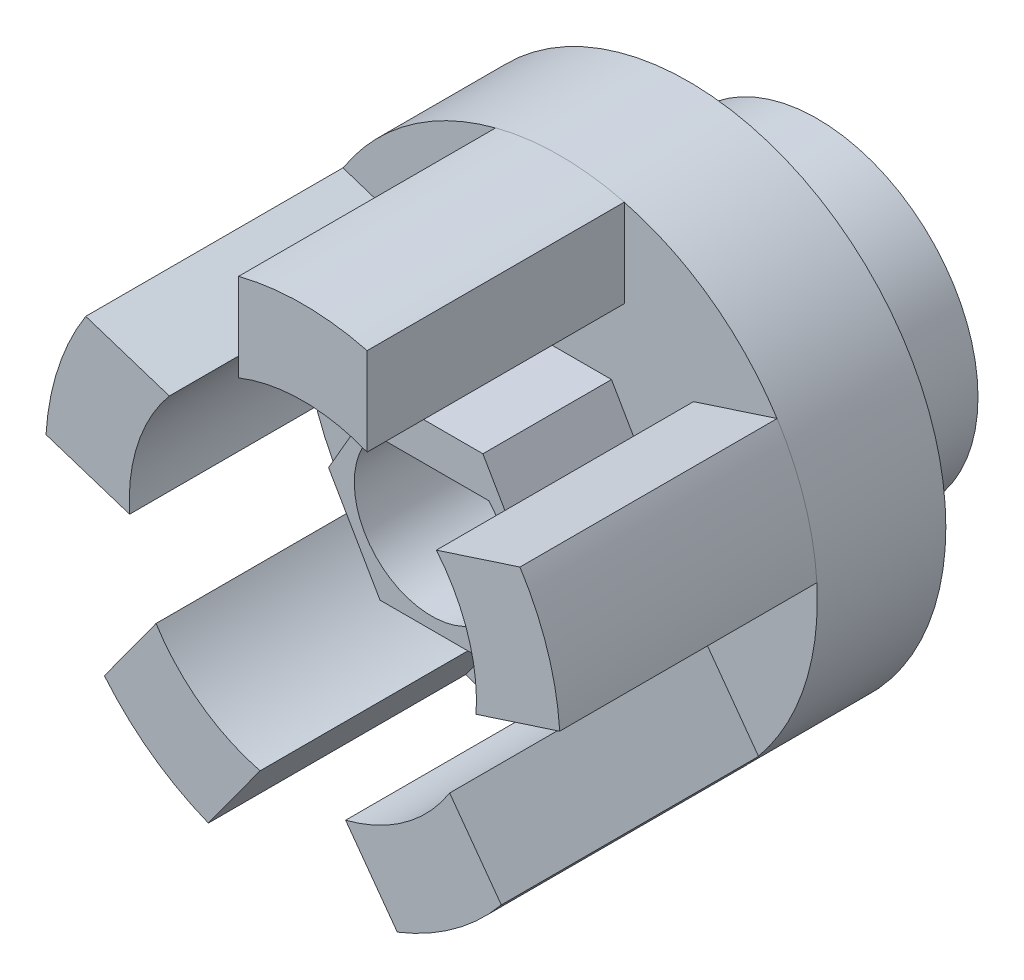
ISO-10303-21;
HEADER;
FILE_DESCRIPTION(('STEP AP214'),'2;1');
FILE_NAME('part.step','',(''),(''),'','','');
FILE_SCHEMA(('AUTOMOTIVE_DESIGN { 1 0 10303 214 1 1 1 1 }'));
ENDSEC;
DATA;
#1=APPLICATION_CONTEXT('core data for automotive mechanical design processes');
#2=APPLICATION_PROTOCOL_DEFINITION('international standard','automotive_design',2000,#1);
#3=PRODUCT_CONTEXT('',#1,'mechanical');
#4=PRODUCT('Part','Part','',(#3));
#5=PRODUCT_RELATED_PRODUCT_CATEGORY('part','',(#4));
#6=PRODUCT_DEFINITION_FORMATION('','',#4);
#7=PRODUCT_DEFINITION_CONTEXT('part definition',#1,'design');
#8=PRODUCT_DEFINITION('design','',#6,#7);
#9=PRODUCT_DEFINITION_SHAPE('','',#8);
#10=(LENGTH_UNIT() NAMED_UNIT(*) SI_UNIT(.MILLI.,.METRE.));
#11=(NAMED_UNIT(*) PLANE_ANGLE_UNIT() SI_UNIT($,.RADIAN.));
#12=(NAMED_UNIT(*) SI_UNIT($,.STERADIAN.) SOLID_ANGLE_UNIT());
#13=UNCERTAINTY_MEASURE_WITH_UNIT(LENGTH_MEASURE(1.E-05),#10,'distance_accuracy_value','');
#14=(GEOMETRIC_REPRESENTATION_CONTEXT(3) GLOBAL_UNCERTAINTY_ASSIGNED_CONTEXT((#13)) GLOBAL_UNIT_ASSIGNED_CONTEXT((#10,
#11,#12)) REPRESENTATION_CONTEXT('',''));
#15=CARTESIAN_POINT('',(0.,0.,0.));
#16=DIRECTION('',(0.,0.,1.));
#17=DIRECTION('',(1.,0.,0.));
#18=AXIS2_PLACEMENT_3D('',#15,#16,#17);
#19=CARTESIAN_POINT('',(0.,0.,5.08));
#20=DIRECTION('',(0.,0.,1.));
#21=DIRECTION('',(1.,0.,0.));
#22=AXIS2_PLACEMENT_3D('',#19,#20,#21);
#23=PLANE('',#22);
#24=DIRECTION('',(0.5,0.866025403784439,0.));
#25=VECTOR('',#24,1.);
#26=CARTESIAN_POINT('',(1.016,-1.75976362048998,5.08));
#27=LINE('',#26,#25);
#28=CARTESIAN_POINT('',(1.016,-1.75976362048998,5.08));
#29=VERTEX_POINT('',#28);
#30=CARTESIAN_POINT('',(2.032,0.,5.08));
#31=VERTEX_POINT('',#30);
#32=EDGE_CURVE('E441',#29,#31,#27,.T.);
#33=ORIENTED_EDGE('',*,*,#32,.F.);
#34=DIRECTION('',(1.,0.,0.));
#35=VECTOR('',#34,1.);
#36=CARTESIAN_POINT('',(-1.016,-1.75976362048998,5.08));
#37=LINE('',#36,#35);
#38=CARTESIAN_POINT('',(-1.016,-1.75976362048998,5.08));
#39=VERTEX_POINT('',#38);
#40=EDGE_CURVE('E448',#39,#29,#37,.T.);
#41=ORIENTED_EDGE('',*,*,#40,.F.);
#42=DIRECTION('',(0.5,-0.866025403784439,0.));
#43=VECTOR('',#42,1.);
#44=CARTESIAN_POINT('',(-2.032,0.,5.08));
#45=LINE('',#44,#43);
#46=CARTESIAN_POINT('',(-2.032,0.,5.08));
#47=VERTEX_POINT('',#46);
#48=EDGE_CURVE('E470',#47,#39,#45,.T.);
#49=ORIENTED_EDGE('',*,*,#48,.F.);
#50=DIRECTION('',(-0.5,-0.866025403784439,0.));
#51=VECTOR('',#50,1.);
#52=CARTESIAN_POINT('',(-1.016,1.75976362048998,5.08));
#53=LINE('',#52,#51);
#54=CARTESIAN_POINT('',(-1.016,1.75976362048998,5.08));
#55=VERTEX_POINT('',#54);
#56=EDGE_CURVE('E467',#55,#47,#53,.T.);
#57=ORIENTED_EDGE('',*,*,#56,.F.);
#58=DIRECTION('',(-1.,0.,0.));
#59=VECTOR('',#58,1.);
#60=CARTESIAN_POINT('',(1.016,1.75976362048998,5.08));
#61=LINE('',#60,#59);
#62=CARTESIAN_POINT('',(1.016,1.75976362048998,5.08));
#63=VERTEX_POINT('',#62);
#64=EDGE_CURVE('E464',#63,#55,#61,.T.);
#65=ORIENTED_EDGE('',*,*,#64,.F.);
#66=DIRECTION('',(-0.5,0.866025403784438,0.));
#67=VECTOR('',#66,1.);
#68=CARTESIAN_POINT('',(2.032,0.,5.08));
#69=LINE('',#68,#67);
#70=EDGE_CURVE('E461',#31,#63,#69,.T.);
#71=ORIENTED_EDGE('',*,*,#70,.F.);
#72=EDGE_LOOP('',(#33,#41,#49,#57,#65,#71));
#73=FACE_BOUND('',#72,.T.);
#74=CARTESIAN_POINT('',(0.,0.,5.08));
#75=DIRECTION('',(0.,0.,-1.));
#76=DIRECTION('',(1.,0.,0.));
#77=AXIS2_PLACEMENT_3D('',#74,#75,#76);
#78=CIRCLE('',#77,3.429);
#79=CARTESIAN_POINT('',(-3.42170334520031,-0.223578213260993,5.08));
#80=VERTEX_POINT('',#79);
#81=CARTESIAN_POINT('',(-2.63680017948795,2.1921053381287,5.08));
#82=VERTEX_POINT('',#81);
#83=EDGE_CURVE('E48',#80,#82,#78,.T.);
#84=ORIENTED_EDGE('',*,*,#83,.F.);
#85=DIRECTION('',(0.951056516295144,-0.309016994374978,0.));
#86=VECTOR('',#85,1.);
#87=CARTESIAN_POINT('',(-5.07304007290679,0.312973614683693,5.08));
#88=LINE('',#87,#86);
#89=CARTESIAN_POINT('',(-5.07040266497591,0.31211666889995,5.08));
#90=VERTEX_POINT('',#89);
#91=EDGE_CURVE('E937',#90,#80,#88,.T.);
#92=ORIENTED_EDGE('',*,*,#91,.F.);
#93=CARTESIAN_POINT('',(0.,0.,5.08));
#94=DIRECTION('',(0.,0.,1.));
#95=DIRECTION('',(1.,0.,0.));
#96=AXIS2_PLACEMENT_3D('',#93,#94,#95);
#97=CIRCLE('',#96,5.08);
#98=CARTESIAN_POINT('',(-3.91858434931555,-3.23281559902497,5.08));
#99=VERTEX_POINT('',#98);
#100=EDGE_CURVE('E427',#90,#99,#97,.T.);
#101=ORIENTED_EDGE('',*,*,#100,.T.);
#102=DIRECTION('',(-0.587785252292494,-0.809016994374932,0.));
#103=VECTOR('',#102,1.);
#104=CARTESIAN_POINT('',(-3.92021435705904,-3.23505911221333,5.08));
#105=LINE('',#104,#103);
#106=CARTESIAN_POINT('',(-2.89963213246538,-1.83034818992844,5.08));
#107=VERTEX_POINT('',#106);
#108=EDGE_CURVE('E286',#107,#99,#105,.T.);
#109=ORIENTED_EDGE('',*,*,#108,.F.);
#110=CARTESIAN_POINT('',(0.,0.,5.08));
#111=DIRECTION('',(0.,0.,-1.));
#112=DIRECTION('',(1.,0.,0.));
#113=AXIS2_PLACEMENT_3D('',#110,#111,#112);
#114=CIRCLE('',#113,3.429);
#115=CARTESIAN_POINT('',(-0.844728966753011,-3.32332273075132,5.08));
#116=VERTEX_POINT('',#115);
#117=EDGE_CURVE('E296',#116,#107,#114,.T.);
#118=ORIENTED_EDGE('',*,*,#117,.F.);
#119=DIRECTION('',(0.587785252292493,0.809016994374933,0.));
#120=VECTOR('',#119,1.);
#121=CARTESIAN_POINT('',(-1.86531119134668,-4.72803365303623,5.08));
#122=LINE('',#121,#120);
#123=CARTESIAN_POINT('',(-1.8636811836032,-4.72579013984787,5.08));
#124=VERTEX_POINT('',#123);
#125=EDGE_CURVE('E276',#124,#116,#122,.T.);
#126=ORIENTED_EDGE('',*,*,#125,.F.);
#127=CARTESIAN_POINT('',(1.86368118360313,-4.7257901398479,5.08));
#128=VERTEX_POINT('',#127);
#129=EDGE_CURVE('E936',#124,#128,#97,.T.);
#130=ORIENTED_EDGE('',*,*,#129,.T.);
#131=DIRECTION('',(0.58778525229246,-0.809016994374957,0.));
#132=VECTOR('',#131,1.);
#133=CARTESIAN_POINT('',(1.86531119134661,-4.72803365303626,5.08));
#134=LINE('',#133,#132);
#135=CARTESIAN_POINT('',(0.844728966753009,-3.32332273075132,5.08));
#136=VERTEX_POINT('',#135);
#137=EDGE_CURVE('E318',#136,#128,#134,.T.);
#138=ORIENTED_EDGE('',*,*,#137,.F.);
#139=CARTESIAN_POINT('',(0.,0.,5.08));
#140=DIRECTION('',(0.,0.,-1.));
#141=DIRECTION('',(1.,0.,0.));
#142=AXIS2_PLACEMENT_3D('',#139,#140,#141);
#143=CIRCLE('',#142,3.429);
#144=CARTESIAN_POINT('',(2.89963213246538,-1.83034818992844,5.08));
#145=VERTEX_POINT('',#144);
#146=EDGE_CURVE('E331',#145,#136,#143,.T.);
#147=ORIENTED_EDGE('',*,*,#146,.F.);
#148=DIRECTION('',(-0.58778525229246,0.809016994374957,0.));
#149=VECTOR('',#148,1.);
#150=CARTESIAN_POINT('',(3.92021435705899,-3.23505911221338,5.08));
#151=LINE('',#150,#149);
#152=CARTESIAN_POINT('',(3.91858434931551,-3.23281559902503,5.08));
#153=VERTEX_POINT('',#152);
#154=EDGE_CURVE('E327',#153,#145,#151,.T.);
#155=ORIENTED_EDGE('',*,*,#154,.F.);
#156=CARTESIAN_POINT('',(5.07040266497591,0.312116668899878,5.08));
#157=VERTEX_POINT('',#156);
#158=EDGE_CURVE('E418',#153,#157,#97,.T.);
#159=ORIENTED_EDGE('',*,*,#158,.T.);
#160=DIRECTION('',(0.951056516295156,0.309016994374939,0.));
#161=VECTOR('',#160,1.);
#162=CARTESIAN_POINT('',(5.07304007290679,0.312973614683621,5.08));
#163=LINE('',#162,#161);
#164=CARTESIAN_POINT('',(3.42170334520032,-0.223578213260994,5.08));
#165=VERTEX_POINT('',#164);
#166=EDGE_CURVE('E388',#165,#157,#163,.T.);
#167=ORIENTED_EDGE('',*,*,#166,.F.);
#168=CARTESIAN_POINT('',(0.,0.,5.08));
#169=DIRECTION('',(0.,0.,-1.));
#170=DIRECTION('',(1.,0.,0.));
#171=AXIS2_PLACEMENT_3D('',#168,#169,#170);
#172=CIRCLE('',#171,3.429);
#173=CARTESIAN_POINT('',(2.63680017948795,2.1921053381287,5.08));
#174=VERTEX_POINT('',#173);
#175=EDGE_CURVE('E401',#174,#165,#172,.T.);
#176=ORIENTED_EDGE('',*,*,#175,.F.);
#177=DIRECTION('',(-0.951056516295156,-0.30901699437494,0.));
#178=VECTOR('',#177,1.);
#179=CARTESIAN_POINT('',(4.28813690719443,2.72865716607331,5.08));
#180=LINE('',#179,#178);
#181=CARTESIAN_POINT('',(4.28549949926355,2.72780022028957,5.08));
#182=VERTEX_POINT('',#181);
#183=EDGE_CURVE('E397',#182,#174,#180,.T.);
#184=ORIENTED_EDGE('',*,*,#183,.F.);
#185=CARTESIAN_POINT('',(1.27,4.91868884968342,5.08));
#186=VERTEX_POINT('',#185);
#187=EDGE_CURVE('E426',#182,#186,#97,.T.);
#188=ORIENTED_EDGE('',*,*,#187,.T.);
#189=DIRECTION('',(0.,1.,0.));
#190=VECTOR('',#189,1.);
#191=CARTESIAN_POINT('',(1.27,4.92146198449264,5.08));
#192=LINE('',#191,#190);
#193=CARTESIAN_POINT('',(1.27,3.18514379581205,5.08));
#194=VERTEX_POINT('',#193);
#195=EDGE_CURVE('E353',#194,#186,#192,.T.);
#196=ORIENTED_EDGE('',*,*,#195,.F.);
#197=CARTESIAN_POINT('',(0.,0.,5.08));
#198=DIRECTION('',(0.,0.,-1.));
#199=DIRECTION('',(1.,0.,0.));
#200=AXIS2_PLACEMENT_3D('',#197,#198,#199);
#201=CIRCLE('',#200,3.429);
#202=CARTESIAN_POINT('',(-1.27,3.18514379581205,5.08));
#203=VERTEX_POINT('',#202);
#204=EDGE_CURVE('E366',#203,#194,#201,.T.);
#205=ORIENTED_EDGE('',*,*,#204,.F.);
#206=DIRECTION('',(0.,-1.,0.));
#207=VECTOR('',#206,1.);
#208=CARTESIAN_POINT('',(-1.27,4.92146198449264,5.08));
#209=LINE('',#208,#207);
#210=CARTESIAN_POINT('',(-1.27,4.91868884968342,5.08));
#211=VERTEX_POINT('',#210);
#212=EDGE_CURVE('E362',#211,#203,#209,.T.);
#213=ORIENTED_EDGE('',*,*,#212,.F.);
#214=CARTESIAN_POINT('',(-4.28549949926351,2.72780022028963,5.08));
#215=VERTEX_POINT('',#214);
#216=EDGE_CURVE('E935',#211,#215,#97,.T.);
#217=ORIENTED_EDGE('',*,*,#216,.T.);
#218=DIRECTION('',(-0.951056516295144,0.309016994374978,0.));
#219=VECTOR('',#218,1.);
#220=CARTESIAN_POINT('',(-4.28813690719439,2.72865716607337,5.08));
#221=LINE('',#220,#219);
#222=EDGE_CURVE('E53',#82,#215,#221,.T.);
#223=ORIENTED_EDGE('',*,*,#222,.F.);
#224=EDGE_LOOP('',(#84,#92,#101,#109,#118,#126,#130,#138,#147,#155,#159,#167,#176,#184,#188,
#196,#205,#213,#217,#223));
#225=FACE_BOUND('',#224,.T.);
#226=ADVANCED_FACE('F33',(#73,#225),#23,.T.);
#227=CARTESIAN_POINT('',(0.,0.,5.08));
#228=DIRECTION('',(0.,0.,-1.));
#229=DIRECTION('',(-1.,0.,0.));
#230=AXIS2_PLACEMENT_3D('',#227,#228,#229);
#231=CYLINDRICAL_SURFACE('',#230,3.175);
#232=CARTESIAN_POINT('',(0.,0.,0.));
#233=DIRECTION('',(0.,0.,1.));
#234=DIRECTION('',(1.,0.,0.));
#235=AXIS2_PLACEMENT_3D('',#232,#233,#234);
#236=CIRCLE('',#235,3.175);
#237=CARTESIAN_POINT('',(3.175,0.,0.));
#238=VERTEX_POINT('',#237);
#239=EDGE_CURVE('E41',#238,#238,#236,.T.);
#240=ORIENTED_EDGE('',*,*,#239,.T.);
#241=EDGE_LOOP('',(#240));
#242=FACE_BOUND('',#241,.T.);
#243=CARTESIAN_POINT('',(0.,0.,2.54));
#244=DIRECTION('',(0.,0.,1.));
#245=DIRECTION('',(1.,0.,0.));
#246=AXIS2_PLACEMENT_3D('',#243,#244,#245);
#247=CIRCLE('',#246,3.175);
#248=CARTESIAN_POINT('',(3.175,0.,2.54));
#249=VERTEX_POINT('',#248);
#250=EDGE_CURVE('E11',#249,#249,#247,.T.);
#251=ORIENTED_EDGE('',*,*,#250,.F.);
#252=EDGE_LOOP('',(#251));
#253=FACE_BOUND('',#252,.T.);
#254=ADVANCED_FACE('F35',(#242,#253),#231,.T.);
#255=CARTESIAN_POINT('',(0.,0.,0.));
#256=DIRECTION('',(0.,0.,1.));
#257=DIRECTION('',(1.,0.,0.));
#258=AXIS2_PLACEMENT_3D('',#255,#256,#257);
#259=PLANE('',#258);
#260=DIRECTION('',(1.,0.,0.));
#261=VECTOR('',#260,1.);
#262=CARTESIAN_POINT('',(1.13592253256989,1.016,0.));
#263=LINE('',#262,#261);
#264=CARTESIAN_POINT('',(-1.13592253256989,1.016,0.));
#265=VERTEX_POINT('',#264);
#266=CARTESIAN_POINT('',(1.13592253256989,1.016,0.));
#267=VERTEX_POINT('',#266);
#268=EDGE_CURVE('E432',#265,#267,#263,.T.);
#269=ORIENTED_EDGE('',*,*,#268,.F.);
#270=CARTESIAN_POINT('',(0.,0.,0.));
#271=DIRECTION('',(0.,0.,-1.));
#272=DIRECTION('',(-1.,0.,0.));
#273=AXIS2_PLACEMENT_3D('',#270,#271,#272);
#274=CIRCLE('',#273,1.524);
#275=EDGE_CURVE('E422',#267,#265,#274,.T.);
#276=ORIENTED_EDGE('',*,*,#275,.F.);
#277=EDGE_LOOP('',(#269,#276));
#278=FACE_BOUND('',#277,.T.);
#279=ORIENTED_EDGE('',*,*,#239,.F.);
#280=EDGE_LOOP('',(#279));
#281=FACE_BOUND('',#280,.T.);
#282=ADVANCED_FACE('F496',(#278,#281),#259,.F.);
#283=CARTESIAN_POINT('',(1.016,-1.75976362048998,7.62));
#284=DIRECTION('',(-0.866025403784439,0.5,0.));
#285=DIRECTION('',(-0.5,-0.866025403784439,0.));
#286=AXIS2_PLACEMENT_3D('',#283,#284,#285);
#287=PLANE('',#286);
#288=ORIENTED_EDGE('',*,*,#32,.T.);
#289=DIRECTION('',(0.,0.,-1.));
#290=VECTOR('',#289,1.);
#291=CARTESIAN_POINT('',(2.032,0.,7.62));
#292=LINE('',#291,#290);
#293=CARTESIAN_POINT('',(2.032,0.,7.62));
#294=VERTEX_POINT('',#293);
#295=EDGE_CURVE('E489',#294,#31,#292,.T.);
#296=ORIENTED_EDGE('',*,*,#295,.F.);
#297=DIRECTION('',(0.5,0.866025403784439,0.));
#298=VECTOR('',#297,1.);
#299=CARTESIAN_POINT('',(1.016,-1.75976362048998,7.62));
#300=LINE('',#299,#298);
#301=CARTESIAN_POINT('',(1.016,-1.75976362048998,7.62));
#302=VERTEX_POINT('',#301);
#303=EDGE_CURVE('E444',#302,#294,#300,.T.);
#304=ORIENTED_EDGE('',*,*,#303,.F.);
#305=DIRECTION('',(0.,0.,-1.));
#306=VECTOR('',#305,1.);
#307=CARTESIAN_POINT('',(1.016,-1.75976362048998,7.62));
#308=LINE('',#307,#306);
#309=EDGE_CURVE('E458',#302,#29,#308,.T.);
#310=ORIENTED_EDGE('',*,*,#309,.T.);
#311=EDGE_LOOP('',(#288,#296,#304,#310));
#312=FACE_BOUND('',#311,.T.);
#313=ADVANCED_FACE('F498',(#312),#287,.F.);
#314=CARTESIAN_POINT('',(2.032,0.,7.62));
#315=DIRECTION('',(-0.866025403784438,-0.5,0.));
#316=DIRECTION('',(0.5,-0.866025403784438,0.));
#317=AXIS2_PLACEMENT_3D('',#314,#315,#316);
#318=PLANE('',#317);
#319=ORIENTED_EDGE('',*,*,#70,.T.);
#320=DIRECTION('',(0.,0.,-1.));
#321=VECTOR('',#320,1.);
#322=CARTESIAN_POINT('',(1.016,1.75976362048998,7.62));
#323=LINE('',#322,#321);
#324=CARTESIAN_POINT('',(1.016,1.75976362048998,7.62));
#325=VERTEX_POINT('',#324);
#326=EDGE_CURVE('E486',#325,#63,#323,.T.);
#327=ORIENTED_EDGE('',*,*,#326,.F.);
#328=DIRECTION('',(-0.5,0.866025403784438,0.));
#329=VECTOR('',#328,1.);
#330=CARTESIAN_POINT('',(2.032,0.,7.62));
#331=LINE('',#330,#329);
#332=EDGE_CURVE('E447',#294,#325,#331,.T.);
#333=ORIENTED_EDGE('',*,*,#332,.F.);
#334=ORIENTED_EDGE('',*,*,#295,.T.);
#335=EDGE_LOOP('',(#319,#327,#333,#334));
#336=FACE_BOUND('',#335,.T.);
#337=ADVANCED_FACE('F504',(#336),#318,.F.);
#338=CARTESIAN_POINT('',(1.016,1.75976362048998,7.62));
#339=DIRECTION('',(0.,-1.,0.));
#340=DIRECTION('',(0.,0.,-1.));
#341=AXIS2_PLACEMENT_3D('',#338,#339,#340);
#342=PLANE('',#341);
#343=ORIENTED_EDGE('',*,*,#64,.T.);
#344=DIRECTION('',(0.,0.,-1.));
#345=VECTOR('',#344,1.);
#346=CARTESIAN_POINT('',(-1.016,1.75976362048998,7.62));
#347=LINE('',#346,#345);
#348=CARTESIAN_POINT('',(-1.016,1.75976362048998,7.62));
#349=VERTEX_POINT('',#348);
#350=EDGE_CURVE('E483',#349,#55,#347,.T.);
#351=ORIENTED_EDGE('',*,*,#350,.F.);
#352=DIRECTION('',(-1.,0.,0.));
#353=VECTOR('',#352,1.);
#354=CARTESIAN_POINT('',(1.016,1.75976362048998,7.62));
#355=LINE('',#354,#353);
#356=EDGE_CURVE('E450',#325,#349,#355,.T.);
#357=ORIENTED_EDGE('',*,*,#356,.F.);
#358=ORIENTED_EDGE('',*,*,#326,.T.);
#359=EDGE_LOOP('',(#343,#351,#357,#358));
#360=FACE_BOUND('',#359,.T.);
#361=ADVANCED_FACE('F516',(#360),#342,.F.);
#362=CARTESIAN_POINT('',(-1.016,1.75976362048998,7.62));
#363=DIRECTION('',(0.866025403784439,-0.5,0.));
#364=DIRECTION('',(0.5,0.866025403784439,0.));
#365=AXIS2_PLACEMENT_3D('',#362,#363,#364);
#366=PLANE('',#365);
#367=ORIENTED_EDGE('',*,*,#56,.T.);
#368=DIRECTION('',(0.,0.,-1.));
#369=VECTOR('',#368,1.);
#370=CARTESIAN_POINT('',(-2.032,0.,7.62));
#371=LINE('',#370,#369);
#372=CARTESIAN_POINT('',(-2.032,0.,7.62));
#373=VERTEX_POINT('',#372);
#374=EDGE_CURVE('E480',#373,#47,#371,.T.);
#375=ORIENTED_EDGE('',*,*,#374,.F.);
#376=DIRECTION('',(-0.5,-0.866025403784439,0.));
#377=VECTOR('',#376,1.);
#378=CARTESIAN_POINT('',(-1.016,1.75976362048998,7.62));
#379=LINE('',#378,#377);
#380=EDGE_CURVE('E452',#349,#373,#379,.T.);
#381=ORIENTED_EDGE('',*,*,#380,.F.);
#382=ORIENTED_EDGE('',*,*,#350,.T.);
#383=EDGE_LOOP('',(#367,#375,#381,#382));
#384=FACE_BOUND('',#383,.T.);
#385=ADVANCED_FACE('F520',(#384),#366,.F.);
#386=CARTESIAN_POINT('',(-2.032,0.,7.62));
#387=DIRECTION('',(0.866025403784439,0.5,0.));
#388=DIRECTION('',(-0.5,0.866025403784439,0.));
#389=AXIS2_PLACEMENT_3D('',#386,#387,#388);
#390=PLANE('',#389);
#391=ORIENTED_EDGE('',*,*,#48,.T.);
#392=DIRECTION('',(0.,0.,-1.));
#393=VECTOR('',#392,1.);
#394=CARTESIAN_POINT('',(-1.016,-1.75976362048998,7.62));
#395=LINE('',#394,#393);
#396=CARTESIAN_POINT('',(-1.016,-1.75976362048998,7.62));
#397=VERTEX_POINT('',#396);
#398=EDGE_CURVE('E477',#397,#39,#395,.T.);
#399=ORIENTED_EDGE('',*,*,#398,.F.);
#400=DIRECTION('',(0.5,-0.866025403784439,0.));
#401=VECTOR('',#400,1.);
#402=CARTESIAN_POINT('',(-2.032,0.,7.62));
#403=LINE('',#402,#401);
#404=EDGE_CURVE('E454',#373,#397,#403,.T.);
#405=ORIENTED_EDGE('',*,*,#404,.F.);
#406=ORIENTED_EDGE('',*,*,#374,.T.);
#407=EDGE_LOOP('',(#391,#399,#405,#406));
#408=FACE_BOUND('',#407,.T.);
#409=ADVANCED_FACE('F524',(#408),#390,.F.);
#410=CARTESIAN_POINT('',(-1.016,-1.75976362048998,7.62));
#411=DIRECTION('',(0.,1.,0.));
#412=DIRECTION('',(-1.,0.,0.));
#413=AXIS2_PLACEMENT_3D('',#410,#411,#412);
#414=PLANE('',#413);
#415=ORIENTED_EDGE('',*,*,#40,.T.);
#416=ORIENTED_EDGE('',*,*,#309,.F.);
#417=DIRECTION('',(1.,0.,0.));
#418=VECTOR('',#417,1.);
#419=CARTESIAN_POINT('',(-1.016,-1.75976362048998,7.62));
#420=LINE('',#419,#418);
#421=EDGE_CURVE('E456',#397,#302,#420,.T.);
#422=ORIENTED_EDGE('',*,*,#421,.F.);
#423=ORIENTED_EDGE('',*,*,#398,.T.);
#424=EDGE_LOOP('',(#415,#416,#422,#423));
#425=FACE_BOUND('',#424,.T.);
#426=ADVANCED_FACE('F528',(#425),#414,.F.);
#427=CARTESIAN_POINT('',(0.,0.,7.62));
#428=DIRECTION('',(0.,0.,1.));
#429=DIRECTION('',(1.,0.,0.));
#430=AXIS2_PLACEMENT_3D('',#427,#428,#429);
#431=PLANE('',#430);
#432=CARTESIAN_POINT('',(0.,0.,7.62));
#433=DIRECTION('',(0.,0.,-1.));
#434=DIRECTION('',(-1.,0.,0.));
#435=AXIS2_PLACEMENT_3D('',#432,#433,#434);
#436=CIRCLE('',#435,1.524);
#437=CARTESIAN_POINT('',(1.13592253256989,1.016,7.62));
#438=VERTEX_POINT('',#437);
#439=CARTESIAN_POINT('',(-1.13592253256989,1.016,7.62));
#440=VERTEX_POINT('',#439);
#441=EDGE_CURVE('E428',#438,#440,#436,.T.);
#442=ORIENTED_EDGE('',*,*,#441,.T.);
#443=DIRECTION('',(1.,0.,0.));
#444=VECTOR('',#443,1.);
#445=CARTESIAN_POINT('',(1.13592253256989,1.016,7.62));
#446=LINE('',#445,#444);
#447=EDGE_CURVE('E431',#440,#438,#446,.T.);
#448=ORIENTED_EDGE('',*,*,#447,.T.);
#449=EDGE_LOOP('',(#442,#448));
#450=FACE_BOUND('',#449,.T.);
#451=ORIENTED_EDGE('',*,*,#303,.T.);
#452=ORIENTED_EDGE('',*,*,#332,.T.);
#453=ORIENTED_EDGE('',*,*,#356,.T.);
#454=ORIENTED_EDGE('',*,*,#380,.T.);
#455=ORIENTED_EDGE('',*,*,#404,.T.);
#456=ORIENTED_EDGE('',*,*,#421,.T.);
#457=EDGE_LOOP('',(#451,#452,#453,#454,#455,#456));
#458=FACE_BOUND('',#457,.T.);
#459=ADVANCED_FACE('F532',(#450,#458),#431,.T.);
#460=CARTESIAN_POINT('',(0.,0.,7.62));
#461=DIRECTION('',(0.,0.,-1.));
#462=DIRECTION('',(-1.,0.,0.));
#463=AXIS2_PLACEMENT_3D('',#460,#461,#462);
#464=CYLINDRICAL_SURFACE('',#463,1.524);
#465=ORIENTED_EDGE('',*,*,#275,.T.);
#466=DIRECTION('',(0.,0.,-1.));
#467=VECTOR('',#466,1.);
#468=CARTESIAN_POINT('',(-1.13592253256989,1.016,7.62));
#469=LINE('',#468,#467);
#470=EDGE_CURVE('E435',#440,#265,#469,.T.);
#471=ORIENTED_EDGE('',*,*,#470,.F.);
#472=ORIENTED_EDGE('',*,*,#441,.F.);
#473=DIRECTION('',(0.,0.,-1.));
#474=VECTOR('',#473,1.);
#475=CARTESIAN_POINT('',(1.13592253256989,1.016,7.62));
#476=LINE('',#475,#474);
#477=EDGE_CURVE('E439',#438,#267,#476,.T.);
#478=ORIENTED_EDGE('',*,*,#477,.T.);
#479=EDGE_LOOP('',(#465,#471,#472,#478));
#480=FACE_BOUND('',#479,.T.);
#481=ADVANCED_FACE('F536',(#480),#464,.F.);
#482=CARTESIAN_POINT('',(1.13592253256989,1.016,7.62));
#483=DIRECTION('',(0.,1.,0.));
#484=DIRECTION('',(0.,0.,1.));
#485=AXIS2_PLACEMENT_3D('',#482,#483,#484);
#486=PLANE('',#485);
#487=ORIENTED_EDGE('',*,*,#268,.T.);
#488=ORIENTED_EDGE('',*,*,#477,.F.);
#489=ORIENTED_EDGE('',*,*,#447,.F.);
#490=ORIENTED_EDGE('',*,*,#470,.T.);
#491=EDGE_LOOP('',(#487,#488,#489,#490));
#492=FACE_BOUND('',#491,.T.);
#493=ADVANCED_FACE('F540',(#492),#486,.F.);
#494=CARTESIAN_POINT('',(0.,0.,2.54));
#495=DIRECTION('',(0.,0.,1.));
#496=DIRECTION('',(1.,0.,0.));
#497=AXIS2_PLACEMENT_3D('',#494,#495,#496);
#498=CYLINDRICAL_SURFACE('',#497,5.08);
#499=CARTESIAN_POINT('',(0.,0.,2.54));
#500=DIRECTION('',(0.,0.,1.));
#501=DIRECTION('',(1.,0.,0.));
#502=AXIS2_PLACEMENT_3D('',#499,#500,#501);
#503=CIRCLE('',#502,5.08);
#504=CARTESIAN_POINT('',(5.08,0.,2.54));
#505=VERTEX_POINT('',#504);
#506=EDGE_CURVE('E419',#505,#505,#503,.T.);
#507=ORIENTED_EDGE('',*,*,#506,.T.);
#508=EDGE_LOOP('',(#507));
#509=FACE_BOUND('',#508,.T.);
#510=EDGE_CURVE('E423',#157,#182,#97,.T.);
#511=ORIENTED_EDGE('',*,*,#510,.F.);
#512=ORIENTED_EDGE('',*,*,#158,.F.);
#513=EDGE_CURVE('E964',#128,#153,#97,.T.);
#514=ORIENTED_EDGE('',*,*,#513,.F.);
#515=ORIENTED_EDGE('',*,*,#129,.F.);
#516=EDGE_CURVE('E949',#99,#124,#97,.T.);
#517=ORIENTED_EDGE('',*,*,#516,.F.);
#518=ORIENTED_EDGE('',*,*,#100,.F.);
#519=EDGE_CURVE('E931',#215,#90,#97,.T.);
#520=ORIENTED_EDGE('',*,*,#519,.F.);
#521=ORIENTED_EDGE('',*,*,#216,.F.);
#522=EDGE_CURVE('E990',#186,#211,#97,.T.);
#523=ORIENTED_EDGE('',*,*,#522,.F.);
#524=ORIENTED_EDGE('',*,*,#187,.F.);
#525=EDGE_LOOP('',(#511,#512,#514,#515,#517,#518,#520,#521,#523,#524));
#526=FACE_BOUND('',#525,.T.);
#527=ADVANCED_FACE('F544',(#509,#526),#498,.T.);
#528=CARTESIAN_POINT('',(0.,0.,2.54));
#529=DIRECTION('',(0.,0.,1.));
#530=DIRECTION('',(1.,0.,0.));
#531=AXIS2_PLACEMENT_3D('',#528,#529,#530);
#532=PLANE('',#531);
#533=ORIENTED_EDGE('',*,*,#250,.T.);
#534=EDGE_LOOP('',(#533));
#535=FACE_BOUND('',#534,.T.);
#536=ORIENTED_EDGE('',*,*,#506,.F.);
#537=EDGE_LOOP('',(#536));
#538=FACE_BOUND('',#537,.T.);
#539=ADVANCED_FACE('F548',(#535,#538),#532,.F.);
#540=CARTESIAN_POINT('',(0.,0.,10.16));
#541=DIRECTION('',(0.,0.,-1.));
#542=DIRECTION('',(-1.,0.,0.));
#543=AXIS2_PLACEMENT_3D('',#540,#541,#542);
#544=CYLINDRICAL_SURFACE('',#543,5.08268512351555);
#545=CARTESIAN_POINT('',(0.,0.,5.08));
#546=DIRECTION('',(0.,0.,1.));
#547=DIRECTION('',(1.,0.,0.));
#548=AXIS2_PLACEMENT_3D('',#545,#546,#547);
#549=CIRCLE('',#548,5.08268512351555);
#550=CARTESIAN_POINT('',(5.07304007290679,0.312973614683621,5.08));
#551=VERTEX_POINT('',#550);
#552=CARTESIAN_POINT('',(4.28813690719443,2.72865716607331,5.08));
#553=VERTEX_POINT('',#552);
#554=EDGE_CURVE('E383',#551,#553,#549,.T.);
#555=ORIENTED_EDGE('',*,*,#554,.T.);
#556=DIRECTION('',(0.,0.,-1.));
#557=VECTOR('',#556,1.);
#558=CARTESIAN_POINT('',(4.28813690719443,2.72865716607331,10.16));
#559=LINE('',#558,#557);
#560=CARTESIAN_POINT('',(4.28813690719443,2.72865716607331,10.16));
#561=VERTEX_POINT('',#560);
#562=EDGE_CURVE('E415',#561,#553,#559,.T.);
#563=ORIENTED_EDGE('',*,*,#562,.F.);
#564=CARTESIAN_POINT('',(0.,0.,10.16));
#565=DIRECTION('',(0.,0.,1.));
#566=DIRECTION('',(1.,0.,0.));
#567=AXIS2_PLACEMENT_3D('',#564,#565,#566);
#568=CIRCLE('',#567,5.08268512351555);
#569=CARTESIAN_POINT('',(5.07304007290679,0.312973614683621,10.16));
#570=VERTEX_POINT('',#569);
#571=EDGE_CURVE('E384',#570,#561,#568,.T.);
#572=ORIENTED_EDGE('',*,*,#571,.F.);
#573=DIRECTION('',(0.,0.,-1.));
#574=VECTOR('',#573,1.);
#575=CARTESIAN_POINT('',(5.07304007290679,0.312973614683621,10.16));
#576=LINE('',#575,#574);
#577=EDGE_CURVE('E394',#570,#551,#576,.T.);
#578=ORIENTED_EDGE('',*,*,#577,.T.);
#579=EDGE_LOOP('',(#555,#563,#572,#578));
#580=FACE_BOUND('',#579,.T.);
#581=ADVANCED_FACE('F552',(#580),#544,.T.);
#582=CARTESIAN_POINT('',(4.28813690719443,2.72865716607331,10.16));
#583=DIRECTION('',(0.30901699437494,-0.951056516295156,0.));
#584=DIRECTION('',(0.951056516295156,0.30901699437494,0.));
#585=AXIS2_PLACEMENT_3D('',#582,#583,#584);
#586=PLANE('',#585);
#587=EDGE_CURVE('E398',#553,#182,#180,.T.);
#588=ORIENTED_EDGE('',*,*,#587,.T.);
#589=ORIENTED_EDGE('',*,*,#183,.T.);
#590=DIRECTION('',(0.,0.,-1.));
#591=VECTOR('',#590,1.);
#592=CARTESIAN_POINT('',(2.63680017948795,2.1921053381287,10.16));
#593=LINE('',#592,#591);
#594=CARTESIAN_POINT('',(2.63680017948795,2.1921053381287,10.16));
#595=VERTEX_POINT('',#594);
#596=EDGE_CURVE('E412',#595,#174,#593,.T.);
#597=ORIENTED_EDGE('',*,*,#596,.F.);
#598=DIRECTION('',(-0.951056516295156,-0.30901699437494,0.));
#599=VECTOR('',#598,1.);
#600=CARTESIAN_POINT('',(4.28813690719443,2.72865716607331,10.16));
#601=LINE('',#600,#599);
#602=EDGE_CURVE('E387',#561,#595,#601,.T.);
#603=ORIENTED_EDGE('',*,*,#602,.F.);
#604=ORIENTED_EDGE('',*,*,#562,.T.);
#605=EDGE_LOOP('',(#588,#589,#597,#603,#604));
#606=FACE_BOUND('',#605,.T.);
#607=ADVANCED_FACE('F556',(#606),#586,.F.);
#608=CARTESIAN_POINT('',(0.,0.,10.16));
#609=DIRECTION('',(0.,0.,-1.));
#610=DIRECTION('',(-1.,0.,0.));
#611=AXIS2_PLACEMENT_3D('',#608,#609,#610);
#612=CYLINDRICAL_SURFACE('',#611,3.429);
#613=ORIENTED_EDGE('',*,*,#175,.T.);
#614=DIRECTION('',(0.,0.,-1.));
#615=VECTOR('',#614,1.);
#616=CARTESIAN_POINT('',(3.42170334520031,-0.223578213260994,10.16));
#617=LINE('',#616,#615);
#618=CARTESIAN_POINT('',(3.42170334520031,-0.223578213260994,10.16));
#619=VERTEX_POINT('',#618);
#620=EDGE_CURVE('E409',#619,#165,#617,.T.);
#621=ORIENTED_EDGE('',*,*,#620,.F.);
#622=CARTESIAN_POINT('',(0.,0.,10.16));
#623=DIRECTION('',(0.,0.,-1.));
#624=DIRECTION('',(1.,0.,0.));
#625=AXIS2_PLACEMENT_3D('',#622,#623,#624);
#626=CIRCLE('',#625,3.429);
#627=EDGE_CURVE('E390',#595,#619,#626,.T.);
#628=ORIENTED_EDGE('',*,*,#627,.F.);
#629=ORIENTED_EDGE('',*,*,#596,.T.);
#630=EDGE_LOOP('',(#613,#621,#628,#629));
#631=FACE_BOUND('',#630,.T.);
#632=ADVANCED_FACE('F560',(#631),#612,.F.);
#633=CARTESIAN_POINT('',(5.07304007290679,0.312973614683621,10.16));
#634=DIRECTION('',(-0.309016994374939,0.951056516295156,0.));
#635=DIRECTION('',(-0.951056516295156,-0.309016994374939,0.));
#636=AXIS2_PLACEMENT_3D('',#633,#634,#635);
#637=PLANE('',#636);
#638=ORIENTED_EDGE('',*,*,#166,.T.);
#639=EDGE_CURVE('E404',#157,#551,#163,.T.);
#640=ORIENTED_EDGE('',*,*,#639,.T.);
#641=ORIENTED_EDGE('',*,*,#577,.F.);
#642=DIRECTION('',(0.951056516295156,0.309016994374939,0.));
#643=VECTOR('',#642,1.);
#644=CARTESIAN_POINT('',(5.07304007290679,0.312973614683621,10.16));
#645=LINE('',#644,#643);
#646=EDGE_CURVE('E392',#619,#570,#645,.T.);
#647=ORIENTED_EDGE('',*,*,#646,.F.);
#648=ORIENTED_EDGE('',*,*,#620,.T.);
#649=EDGE_LOOP('',(#638,#640,#641,#647,#648));
#650=FACE_BOUND('',#649,.T.);
#651=ADVANCED_FACE('F564',(#650),#637,.F.);
#652=CARTESIAN_POINT('',(0.,0.,10.16));
#653=DIRECTION('',(0.,0.,1.));
#654=DIRECTION('',(1.,0.,0.));
#655=AXIS2_PLACEMENT_3D('',#652,#653,#654);
#656=PLANE('',#655);
#657=ORIENTED_EDGE('',*,*,#571,.T.);
#658=ORIENTED_EDGE('',*,*,#602,.T.);
#659=ORIENTED_EDGE('',*,*,#627,.T.);
#660=ORIENTED_EDGE('',*,*,#646,.T.);
#661=EDGE_LOOP('',(#657,#658,#659,#660));
#662=FACE_BOUND('',#661,.T.);
#663=ADVANCED_FACE('F568',(#662),#656,.T.);
#664=CARTESIAN_POINT('',(0.,0.,5.08));
#665=DIRECTION('',(0.,0.,1.));
#666=DIRECTION('',(1.,0.,0.));
#667=AXIS2_PLACEMENT_3D('',#664,#665,#666);
#668=PLANE('',#667);
#669=ORIENTED_EDGE('',*,*,#510,.T.);
#670=ORIENTED_EDGE('',*,*,#587,.F.);
#671=ORIENTED_EDGE('',*,*,#554,.F.);
#672=ORIENTED_EDGE('',*,*,#639,.F.);
#673=EDGE_LOOP('',(#669,#670,#671,#672));
#674=FACE_BOUND('',#673,.T.);
#675=ADVANCED_FACE('F570',(#674),#668,.F.);
#676=CARTESIAN_POINT('',(0.,0.,10.16));
#677=DIRECTION('',(0.,0.,-1.));
#678=DIRECTION('',(-1.,0.,0.));
#679=AXIS2_PLACEMENT_3D('',#676,#677,#678);
#680=CYLINDRICAL_SURFACE('',#679,5.08268512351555);
#681=CARTESIAN_POINT('',(0.,0.,5.08));
#682=DIRECTION('',(0.,0.,1.));
#683=DIRECTION('',(1.,0.,0.));
#684=AXIS2_PLACEMENT_3D('',#681,#682,#683);
#685=CIRCLE('',#684,5.08268512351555);
#686=CARTESIAN_POINT('',(1.27,4.92146198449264,5.08));
#687=VERTEX_POINT('',#686);
#688=CARTESIAN_POINT('',(-1.27,4.92146198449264,5.08));
#689=VERTEX_POINT('',#688);
#690=EDGE_CURVE('E348',#687,#689,#685,.T.);
#691=ORIENTED_EDGE('',*,*,#690,.T.);
#692=DIRECTION('',(0.,0.,-1.));
#693=VECTOR('',#692,1.);
#694=CARTESIAN_POINT('',(-1.27,4.92146198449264,10.16));
#695=LINE('',#694,#693);
#696=CARTESIAN_POINT('',(-1.27,4.92146198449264,10.16));
#697=VERTEX_POINT('',#696);
#698=EDGE_CURVE('E380',#697,#689,#695,.T.);
#699=ORIENTED_EDGE('',*,*,#698,.F.);
#700=CARTESIAN_POINT('',(0.,0.,10.16));
#701=DIRECTION('',(0.,0.,1.));
#702=DIRECTION('',(1.,0.,0.));
#703=AXIS2_PLACEMENT_3D('',#700,#701,#702);
#704=CIRCLE('',#703,5.08268512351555);
#705=CARTESIAN_POINT('',(1.27,4.92146198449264,10.16));
#706=VERTEX_POINT('',#705);
#707=EDGE_CURVE('E349',#706,#697,#704,.T.);
#708=ORIENTED_EDGE('',*,*,#707,.F.);
#709=DIRECTION('',(0.,0.,-1.));
#710=VECTOR('',#709,1.);
#711=CARTESIAN_POINT('',(1.27,4.92146198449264,10.16));
#712=LINE('',#711,#710);
#713=EDGE_CURVE('E359',#706,#687,#712,.T.);
#714=ORIENTED_EDGE('',*,*,#713,.T.);
#715=EDGE_LOOP('',(#691,#699,#708,#714));
#716=FACE_BOUND('',#715,.T.);
#717=ADVANCED_FACE('F573',(#716),#680,.T.);
#718=CARTESIAN_POINT('',(-1.27,4.92146198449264,10.16));
#719=DIRECTION('',(1.,0.,0.));
#720=DIRECTION('',(0.,1.,0.));
#721=AXIS2_PLACEMENT_3D('',#718,#719,#720);
#722=PLANE('',#721);
#723=EDGE_CURVE('E363',#689,#211,#209,.T.);
#724=ORIENTED_EDGE('',*,*,#723,.T.);
#725=ORIENTED_EDGE('',*,*,#212,.T.);
#726=DIRECTION('',(0.,0.,-1.));
#727=VECTOR('',#726,1.);
#728=CARTESIAN_POINT('',(-1.27,3.18514379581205,10.16));
#729=LINE('',#728,#727);
#730=CARTESIAN_POINT('',(-1.27,3.18514379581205,10.16));
#731=VERTEX_POINT('',#730);
#732=EDGE_CURVE('E377',#731,#203,#729,.T.);
#733=ORIENTED_EDGE('',*,*,#732,.F.);
#734=DIRECTION('',(0.,-1.,0.));
#735=VECTOR('',#734,1.);
#736=CARTESIAN_POINT('',(-1.27,4.92146198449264,10.16));
#737=LINE('',#736,#735);
#738=EDGE_CURVE('E352',#697,#731,#737,.T.);
#739=ORIENTED_EDGE('',*,*,#738,.F.);
#740=ORIENTED_EDGE('',*,*,#698,.T.);
#741=EDGE_LOOP('',(#724,#725,#733,#739,#740));
#742=FACE_BOUND('',#741,.T.);
#743=ADVANCED_FACE('F580',(#742),#722,.F.);
#744=CARTESIAN_POINT('',(0.,0.,10.16));
#745=DIRECTION('',(0.,0.,-1.));
#746=DIRECTION('',(-1.,0.,0.));
#747=AXIS2_PLACEMENT_3D('',#744,#745,#746);
#748=CYLINDRICAL_SURFACE('',#747,3.429);
#749=ORIENTED_EDGE('',*,*,#204,.T.);
#750=DIRECTION('',(0.,0.,-1.));
#751=VECTOR('',#750,1.);
#752=CARTESIAN_POINT('',(1.27,3.18514379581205,10.16));
#753=LINE('',#752,#751);
#754=CARTESIAN_POINT('',(1.27,3.18514379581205,10.16));
#755=VERTEX_POINT('',#754);
#756=EDGE_CURVE('E374',#755,#194,#753,.T.);
#757=ORIENTED_EDGE('',*,*,#756,.F.);
#758=CARTESIAN_POINT('',(0.,0.,10.16));
#759=DIRECTION('',(0.,0.,-1.));
#760=DIRECTION('',(1.,0.,0.));
#761=AXIS2_PLACEMENT_3D('',#758,#759,#760);
#762=CIRCLE('',#761,3.429);
#763=EDGE_CURVE('E355',#731,#755,#762,.T.);
#764=ORIENTED_EDGE('',*,*,#763,.F.);
#765=ORIENTED_EDGE('',*,*,#732,.T.);
#766=EDGE_LOOP('',(#749,#757,#764,#765));
#767=FACE_BOUND('',#766,.T.);
#768=ADVANCED_FACE('F584',(#767),#748,.F.);
#769=CARTESIAN_POINT('',(1.27,4.92146198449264,10.16));
#770=DIRECTION('',(-1.,0.,0.));
#771=DIRECTION('',(0.,-1.,0.));
#772=AXIS2_PLACEMENT_3D('',#769,#770,#771);
#773=PLANE('',#772);
#774=ORIENTED_EDGE('',*,*,#195,.T.);
#775=EDGE_CURVE('E369',#186,#687,#192,.T.);
#776=ORIENTED_EDGE('',*,*,#775,.T.);
#777=ORIENTED_EDGE('',*,*,#713,.F.);
#778=DIRECTION('',(0.,1.,0.));
#779=VECTOR('',#778,1.);
#780=CARTESIAN_POINT('',(1.27,4.92146198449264,10.16));
#781=LINE('',#780,#779);
#782=EDGE_CURVE('E357',#755,#706,#781,.T.);
#783=ORIENTED_EDGE('',*,*,#782,.F.);
#784=ORIENTED_EDGE('',*,*,#756,.T.);
#785=EDGE_LOOP('',(#774,#776,#777,#783,#784));
#786=FACE_BOUND('',#785,.T.);
#787=ADVANCED_FACE('F588',(#786),#773,.F.);
#788=CARTESIAN_POINT('',(0.,0.,10.16));
#789=DIRECTION('',(0.,0.,1.));
#790=DIRECTION('',(1.,0.,0.));
#791=AXIS2_PLACEMENT_3D('',#788,#789,#790);
#792=PLANE('',#791);
#793=ORIENTED_EDGE('',*,*,#707,.T.);
#794=ORIENTED_EDGE('',*,*,#738,.T.);
#795=ORIENTED_EDGE('',*,*,#763,.T.);
#796=ORIENTED_EDGE('',*,*,#782,.T.);
#797=EDGE_LOOP('',(#793,#794,#795,#796));
#798=FACE_BOUND('',#797,.T.);
#799=ADVANCED_FACE('F592',(#798),#792,.T.);
#800=CARTESIAN_POINT('',(0.,0.,5.08));
#801=DIRECTION('',(0.,0.,1.));
#802=DIRECTION('',(1.,0.,0.));
#803=AXIS2_PLACEMENT_3D('',#800,#801,#802);
#804=PLANE('',#803);
#805=ORIENTED_EDGE('',*,*,#522,.T.);
#806=ORIENTED_EDGE('',*,*,#723,.F.);
#807=ORIENTED_EDGE('',*,*,#690,.F.);
#808=ORIENTED_EDGE('',*,*,#775,.F.);
#809=EDGE_LOOP('',(#805,#806,#807,#808));
#810=FACE_BOUND('',#809,.T.);
#811=ADVANCED_FACE('F594',(#810),#804,.F.);
#812=CARTESIAN_POINT('',(0.,0.,10.16));
#813=DIRECTION('',(0.,0.,-1.));
#814=DIRECTION('',(-1.,0.,0.));
#815=AXIS2_PLACEMENT_3D('',#812,#813,#814);
#816=CYLINDRICAL_SURFACE('',#815,5.08268512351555);
#817=CARTESIAN_POINT('',(0.,0.,5.08));
#818=DIRECTION('',(0.,0.,1.));
#819=DIRECTION('',(1.,0.,0.));
#820=AXIS2_PLACEMENT_3D('',#817,#818,#819);
#821=CIRCLE('',#820,5.08268512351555);
#822=CARTESIAN_POINT('',(1.86531119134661,-4.72803365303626,5.08));
#823=VERTEX_POINT('',#822);
#824=CARTESIAN_POINT('',(3.92021435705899,-3.23505911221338,5.08));
#825=VERTEX_POINT('',#824);
#826=EDGE_CURVE('E313',#823,#825,#821,.T.);
#827=ORIENTED_EDGE('',*,*,#826,.T.);
#828=DIRECTION('',(0.,0.,-1.));
#829=VECTOR('',#828,1.);
#830=CARTESIAN_POINT('',(3.92021435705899,-3.23505911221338,10.16));
#831=LINE('',#830,#829);
#832=CARTESIAN_POINT('',(3.92021435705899,-3.23505911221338,10.16));
#833=VERTEX_POINT('',#832);
#834=EDGE_CURVE('E345',#833,#825,#831,.T.);
#835=ORIENTED_EDGE('',*,*,#834,.F.);
#836=CARTESIAN_POINT('',(0.,0.,10.16));
#837=DIRECTION('',(0.,0.,1.));
#838=DIRECTION('',(1.,0.,0.));
#839=AXIS2_PLACEMENT_3D('',#836,#837,#838);
#840=CIRCLE('',#839,5.08268512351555);
#841=CARTESIAN_POINT('',(1.86531119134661,-4.72803365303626,10.16));
#842=VERTEX_POINT('',#841);
#843=EDGE_CURVE('E314',#842,#833,#840,.T.);
#844=ORIENTED_EDGE('',*,*,#843,.F.);
#845=DIRECTION('',(0.,0.,-1.));
#846=VECTOR('',#845,1.);
#847=CARTESIAN_POINT('',(1.86531119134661,-4.72803365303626,10.16));
#848=LINE('',#847,#846);
#849=EDGE_CURVE('E324',#842,#823,#848,.T.);
#850=ORIENTED_EDGE('',*,*,#849,.T.);
#851=EDGE_LOOP('',(#827,#835,#844,#850));
#852=FACE_BOUND('',#851,.T.);
#853=ADVANCED_FACE('F597',(#852),#816,.T.);
#854=CARTESIAN_POINT('',(3.92021435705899,-3.23505911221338,10.16));
#855=DIRECTION('',(-0.809016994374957,-0.58778525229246,0.));
#856=DIRECTION('',(0.58778525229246,-0.809016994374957,0.));
#857=AXIS2_PLACEMENT_3D('',#854,#855,#856);
#858=PLANE('',#857);
#859=EDGE_CURVE('E328',#825,#153,#151,.T.);
#860=ORIENTED_EDGE('',*,*,#859,.T.);
#861=ORIENTED_EDGE('',*,*,#154,.T.);
#862=DIRECTION('',(0.,0.,-1.));
#863=VECTOR('',#862,1.);
#864=CARTESIAN_POINT('',(2.89963213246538,-1.83034818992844,10.16));
#865=LINE('',#864,#863);
#866=CARTESIAN_POINT('',(2.89963213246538,-1.83034818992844,10.16));
#867=VERTEX_POINT('',#866);
#868=EDGE_CURVE('E342',#867,#145,#865,.T.);
#869=ORIENTED_EDGE('',*,*,#868,.F.);
#870=DIRECTION('',(-0.58778525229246,0.809016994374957,0.));
#871=VECTOR('',#870,1.);
#872=CARTESIAN_POINT('',(3.92021435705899,-3.23505911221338,10.16));
#873=LINE('',#872,#871);
#874=EDGE_CURVE('E317',#833,#867,#873,.T.);
#875=ORIENTED_EDGE('',*,*,#874,.F.);
#876=ORIENTED_EDGE('',*,*,#834,.T.);
#877=EDGE_LOOP('',(#860,#861,#869,#875,#876));
#878=FACE_BOUND('',#877,.T.);
#879=ADVANCED_FACE('F604',(#878),#858,.F.);
#880=CARTESIAN_POINT('',(0.,0.,10.16));
#881=DIRECTION('',(0.,0.,-1.));
#882=DIRECTION('',(-1.,0.,0.));
#883=AXIS2_PLACEMENT_3D('',#880,#881,#882);
#884=CYLINDRICAL_SURFACE('',#883,3.429);
#885=ORIENTED_EDGE('',*,*,#146,.T.);
#886=DIRECTION('',(0.,0.,-1.));
#887=VECTOR('',#886,1.);
#888=CARTESIAN_POINT('',(0.844728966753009,-3.32332273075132,10.16));
#889=LINE('',#888,#887);
#890=CARTESIAN_POINT('',(0.844728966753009,-3.32332273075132,10.16));
#891=VERTEX_POINT('',#890);
#892=EDGE_CURVE('E339',#891,#136,#889,.T.);
#893=ORIENTED_EDGE('',*,*,#892,.F.);
#894=CARTESIAN_POINT('',(0.,0.,10.16));
#895=DIRECTION('',(0.,0.,-1.));
#896=DIRECTION('',(1.,0.,0.));
#897=AXIS2_PLACEMENT_3D('',#894,#895,#896);
#898=CIRCLE('',#897,3.429);
#899=EDGE_CURVE('E320',#867,#891,#898,.T.);
#900=ORIENTED_EDGE('',*,*,#899,.F.);
#901=ORIENTED_EDGE('',*,*,#868,.T.);
#902=EDGE_LOOP('',(#885,#893,#900,#901));
#903=FACE_BOUND('',#902,.T.);
#904=ADVANCED_FACE('F608',(#903),#884,.F.);
#905=CARTESIAN_POINT('',(1.86531119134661,-4.72803365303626,10.16));
#906=DIRECTION('',(0.809016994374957,0.58778525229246,0.));
#907=DIRECTION('',(-0.58778525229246,0.809016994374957,0.));
#908=AXIS2_PLACEMENT_3D('',#905,#906,#907);
#909=PLANE('',#908);
#910=ORIENTED_EDGE('',*,*,#137,.T.);
#911=EDGE_CURVE('E334',#128,#823,#134,.T.);
#912=ORIENTED_EDGE('',*,*,#911,.T.);
#913=ORIENTED_EDGE('',*,*,#849,.F.);
#914=DIRECTION('',(0.58778525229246,-0.809016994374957,0.));
#915=VECTOR('',#914,1.);
#916=CARTESIAN_POINT('',(1.86531119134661,-4.72803365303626,10.16));
#917=LINE('',#916,#915);
#918=EDGE_CURVE('E322',#891,#842,#917,.T.);
#919=ORIENTED_EDGE('',*,*,#918,.F.);
#920=ORIENTED_EDGE('',*,*,#892,.T.);
#921=EDGE_LOOP('',(#910,#912,#913,#919,#920));
#922=FACE_BOUND('',#921,.T.);
#923=ADVANCED_FACE('F612',(#922),#909,.F.);
#924=CARTESIAN_POINT('',(0.,0.,10.16));
#925=DIRECTION('',(0.,0.,1.));
#926=DIRECTION('',(1.,0.,0.));
#927=AXIS2_PLACEMENT_3D('',#924,#925,#926);
#928=PLANE('',#927);
#929=ORIENTED_EDGE('',*,*,#843,.T.);
#930=ORIENTED_EDGE('',*,*,#874,.T.);
#931=ORIENTED_EDGE('',*,*,#899,.T.);
#932=ORIENTED_EDGE('',*,*,#918,.T.);
#933=EDGE_LOOP('',(#929,#930,#931,#932));
#934=FACE_BOUND('',#933,.T.);
#935=ADVANCED_FACE('F616',(#934),#928,.T.);
#936=CARTESIAN_POINT('',(0.,0.,5.08));
#937=DIRECTION('',(0.,0.,1.));
#938=DIRECTION('',(1.,0.,0.));
#939=AXIS2_PLACEMENT_3D('',#936,#937,#938);
#940=PLANE('',#939);
#941=ORIENTED_EDGE('',*,*,#513,.T.);
#942=ORIENTED_EDGE('',*,*,#859,.F.);
#943=ORIENTED_EDGE('',*,*,#826,.F.);
#944=ORIENTED_EDGE('',*,*,#911,.F.);
#945=EDGE_LOOP('',(#941,#942,#943,#944));
#946=FACE_BOUND('',#945,.T.);
#947=ADVANCED_FACE('F618',(#946),#940,.F.);
#948=CARTESIAN_POINT('',(0.,0.,10.16));
#949=DIRECTION('',(0.,0.,-1.));
#950=DIRECTION('',(-1.,0.,0.));
#951=AXIS2_PLACEMENT_3D('',#948,#949,#950);
#952=CYLINDRICAL_SURFACE('',#951,5.08268512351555);
#953=CARTESIAN_POINT('',(0.,0.,5.08));
#954=DIRECTION('',(0.,0.,1.));
#955=DIRECTION('',(1.,0.,0.));
#956=AXIS2_PLACEMENT_3D('',#953,#954,#955);
#957=CIRCLE('',#956,5.08268512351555);
#958=CARTESIAN_POINT('',(-3.92021435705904,-3.23505911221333,5.08));
#959=VERTEX_POINT('',#958);
#960=CARTESIAN_POINT('',(-1.86531119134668,-4.72803365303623,5.08));
#961=VERTEX_POINT('',#960);
#962=EDGE_CURVE('E273',#959,#961,#957,.T.);
#963=ORIENTED_EDGE('',*,*,#962,.T.);
#964=DIRECTION('',(0.,0.,-1.));
#965=VECTOR('',#964,1.);
#966=CARTESIAN_POINT('',(-1.86531119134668,-4.72803365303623,10.16));
#967=LINE('',#966,#965);
#968=CARTESIAN_POINT('',(-1.86531119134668,-4.72803365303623,10.16));
#969=VERTEX_POINT('',#968);
#970=EDGE_CURVE('E310',#969,#961,#967,.T.);
#971=ORIENTED_EDGE('',*,*,#970,.F.);
#972=CARTESIAN_POINT('',(0.,0.,10.16));
#973=DIRECTION('',(0.,0.,1.));
#974=DIRECTION('',(1.,0.,0.));
#975=AXIS2_PLACEMENT_3D('',#972,#973,#974);
#976=CIRCLE('',#975,5.08268512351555);
#977=CARTESIAN_POINT('',(-3.92021435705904,-3.23505911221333,10.16));
#978=VERTEX_POINT('',#977);
#979=EDGE_CURVE('E282',#978,#969,#976,.T.);
#980=ORIENTED_EDGE('',*,*,#979,.F.);
#981=DIRECTION('',(0.,0.,-1.));
#982=VECTOR('',#981,1.);
#983=CARTESIAN_POINT('',(-3.92021435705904,-3.23505911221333,10.16));
#984=LINE('',#983,#982);
#985=EDGE_CURVE('E291',#978,#959,#984,.T.);
#986=ORIENTED_EDGE('',*,*,#985,.T.);
#987=EDGE_LOOP('',(#963,#971,#980,#986));
#988=FACE_BOUND('',#987,.T.);
#989=ADVANCED_FACE('F621',(#988),#952,.T.);
#990=CARTESIAN_POINT('',(-1.86531119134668,-4.72803365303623,10.16));
#991=DIRECTION('',(-0.809016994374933,0.587785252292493,0.));
#992=DIRECTION('',(-0.587785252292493,-0.809016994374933,0.));
#993=AXIS2_PLACEMENT_3D('',#990,#991,#992);
#994=PLANE('',#993);
#995=EDGE_CURVE('E293',#961,#124,#122,.T.);
#996=ORIENTED_EDGE('',*,*,#995,.T.);
#997=ORIENTED_EDGE('',*,*,#125,.T.);
#998=DIRECTION('',(0.,0.,-1.));
#999=VECTOR('',#998,1.);
#1000=CARTESIAN_POINT('',(-0.844728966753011,-3.32332273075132,10.16));
#1001=LINE('',#1000,#999);
#1002=CARTESIAN_POINT('',(-0.844728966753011,-3.32332273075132,10.16));
#1003=VERTEX_POINT('',#1002);
#1004=EDGE_CURVE('E307',#1003,#116,#1001,.T.);
#1005=ORIENTED_EDGE('',*,*,#1004,.F.);
#1006=DIRECTION('',(0.587785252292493,0.809016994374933,0.));
#1007=VECTOR('',#1006,1.);
#1008=CARTESIAN_POINT('',(-1.86531119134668,-4.72803365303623,10.16));
#1009=LINE('',#1008,#1007);
#1010=EDGE_CURVE('E285',#969,#1003,#1009,.T.);
#1011=ORIENTED_EDGE('',*,*,#1010,.F.);
#1012=ORIENTED_EDGE('',*,*,#970,.T.);
#1013=EDGE_LOOP('',(#996,#997,#1005,#1011,#1012));
#1014=FACE_BOUND('',#1013,.T.);
#1015=ADVANCED_FACE('F628',(#1014),#994,.F.);
#1016=CARTESIAN_POINT('',(0.,0.,10.16));
#1017=DIRECTION('',(0.,0.,-1.));
#1018=DIRECTION('',(-1.,0.,0.));
#1019=AXIS2_PLACEMENT_3D('',#1016,#1017,#1018);
#1020=CYLINDRICAL_SURFACE('',#1019,3.429);
#1021=ORIENTED_EDGE('',*,*,#117,.T.);
#1022=DIRECTION('',(0.,0.,-1.));
#1023=VECTOR('',#1022,1.);
#1024=CARTESIAN_POINT('',(-2.89963213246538,-1.83034818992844,10.16));
#1025=LINE('',#1024,#1023);
#1026=CARTESIAN_POINT('',(-2.89963213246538,-1.83034818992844,10.16));
#1027=VERTEX_POINT('',#1026);
#1028=EDGE_CURVE('E304',#1027,#107,#1025,.T.);
#1029=ORIENTED_EDGE('',*,*,#1028,.F.);
#1030=CARTESIAN_POINT('',(0.,0.,10.16));
#1031=DIRECTION('',(0.,0.,-1.));
#1032=DIRECTION('',(1.,0.,0.));
#1033=AXIS2_PLACEMENT_3D('',#1030,#1031,#1032);
#1034=CIRCLE('',#1033,3.429);
#1035=EDGE_CURVE('E288',#1003,#1027,#1034,.T.);
#1036=ORIENTED_EDGE('',*,*,#1035,.F.);
#1037=ORIENTED_EDGE('',*,*,#1004,.T.);
#1038=EDGE_LOOP('',(#1021,#1029,#1036,#1037));
#1039=FACE_BOUND('',#1038,.T.);
#1040=ADVANCED_FACE('F632',(#1039),#1020,.F.);
#1041=CARTESIAN_POINT('',(-3.92021435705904,-3.23505911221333,10.16));
#1042=DIRECTION('',(0.809016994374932,-0.587785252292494,0.));
#1043=DIRECTION('',(0.587785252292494,0.809016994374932,0.));
#1044=AXIS2_PLACEMENT_3D('',#1041,#1042,#1043);
#1045=PLANE('',#1044);
#1046=ORIENTED_EDGE('',*,*,#108,.T.);
#1047=EDGE_CURVE('E299',#99,#959,#105,.T.);
#1048=ORIENTED_EDGE('',*,*,#1047,.T.);
#1049=ORIENTED_EDGE('',*,*,#985,.F.);
#1050=DIRECTION('',(-0.587785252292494,-0.809016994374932,0.));
#1051=VECTOR('',#1050,1.);
#1052=CARTESIAN_POINT('',(-3.92021435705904,-3.23505911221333,10.16));
#1053=LINE('',#1052,#1051);
#1054=EDGE_CURVE('E290',#1027,#978,#1053,.T.);
#1055=ORIENTED_EDGE('',*,*,#1054,.F.);
#1056=ORIENTED_EDGE('',*,*,#1028,.T.);
#1057=EDGE_LOOP('',(#1046,#1048,#1049,#1055,#1056));
#1058=FACE_BOUND('',#1057,.T.);
#1059=ADVANCED_FACE('F636',(#1058),#1045,.F.);
#1060=CARTESIAN_POINT('',(0.,0.,10.16));
#1061=DIRECTION('',(0.,0.,1.));
#1062=DIRECTION('',(1.,0.,0.));
#1063=AXIS2_PLACEMENT_3D('',#1060,#1061,#1062);
#1064=PLANE('',#1063);
#1065=ORIENTED_EDGE('',*,*,#979,.T.);
#1066=ORIENTED_EDGE('',*,*,#1010,.T.);
#1067=ORIENTED_EDGE('',*,*,#1035,.T.);
#1068=ORIENTED_EDGE('',*,*,#1054,.T.);
#1069=EDGE_LOOP('',(#1065,#1066,#1067,#1068));
#1070=FACE_BOUND('',#1069,.T.);
#1071=ADVANCED_FACE('F640',(#1070),#1064,.T.);
#1072=CARTESIAN_POINT('',(0.,0.,5.08));
#1073=DIRECTION('',(0.,0.,1.));
#1074=DIRECTION('',(1.,0.,0.));
#1075=AXIS2_PLACEMENT_3D('',#1072,#1073,#1074);
#1076=PLANE('',#1075);
#1077=ORIENTED_EDGE('',*,*,#516,.T.);
#1078=ORIENTED_EDGE('',*,*,#995,.F.);
#1079=ORIENTED_EDGE('',*,*,#962,.F.);
#1080=ORIENTED_EDGE('',*,*,#1047,.F.);
#1081=EDGE_LOOP('',(#1077,#1078,#1079,#1080));
#1082=FACE_BOUND('',#1081,.T.);
#1083=ADVANCED_FACE('F642',(#1082),#1076,.F.);
#1084=CARTESIAN_POINT('',(0.,0.,10.16));
#1085=DIRECTION('',(0.,0.,-1.));
#1086=DIRECTION('',(-1.,0.,0.));
#1087=AXIS2_PLACEMENT_3D('',#1084,#1085,#1086);
#1088=CYLINDRICAL_SURFACE('',#1087,5.08268512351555);
#1089=CARTESIAN_POINT('',(0.,0.,5.08));
#1090=DIRECTION('',(0.,0.,1.));
#1091=DIRECTION('',(1.,0.,0.));
#1092=AXIS2_PLACEMENT_3D('',#1089,#1090,#1091);
#1093=CIRCLE('',#1092,5.08268512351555);
#1094=CARTESIAN_POINT('',(-4.28813690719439,2.72865716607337,5.08));
#1095=VERTEX_POINT('',#1094);
#1096=CARTESIAN_POINT('',(-5.07304007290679,0.312973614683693,5.08));
#1097=VERTEX_POINT('',#1096);
#1098=EDGE_CURVE('E272',#1095,#1097,#1093,.T.);
#1099=ORIENTED_EDGE('',*,*,#1098,.T.);
#1100=DIRECTION('',(0.,0.,-1.));
#1101=VECTOR('',#1100,1.);
#1102=CARTESIAN_POINT('',(-5.07304007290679,0.312973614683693,10.16));
#1103=LINE('',#1102,#1101);
#1104=CARTESIAN_POINT('',(-5.07304007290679,0.312973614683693,10.16));
#1105=VERTEX_POINT('',#1104);
#1106=EDGE_CURVE('E253',#1105,#1097,#1103,.T.);
#1107=ORIENTED_EDGE('',*,*,#1106,.F.);
#1108=CARTESIAN_POINT('',(0.,0.,10.16));
#1109=DIRECTION('',(0.,0.,1.));
#1110=DIRECTION('',(1.,0.,0.));
#1111=AXIS2_PLACEMENT_3D('',#1108,#1109,#1110);
#1112=CIRCLE('',#1111,5.08268512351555);
#1113=CARTESIAN_POINT('',(-4.28813690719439,2.72865716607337,10.16));
#1114=VERTEX_POINT('',#1113);
#1115=EDGE_CURVE('E260',#1114,#1105,#1112,.T.);
#1116=ORIENTED_EDGE('',*,*,#1115,.F.);
#1117=DIRECTION('',(0.,0.,-1.));
#1118=VECTOR('',#1117,1.);
#1119=CARTESIAN_POINT('',(-4.28813690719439,2.72865716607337,10.16));
#1120=LINE('',#1119,#1118);
#1121=EDGE_CURVE('E944',#1114,#1095,#1120,.T.);
#1122=ORIENTED_EDGE('',*,*,#1121,.T.);
#1123=EDGE_LOOP('',(#1099,#1107,#1116,#1122));
#1124=FACE_BOUND('',#1123,.T.);
#1125=ADVANCED_FACE('F270',(#1124),#1088,.T.);
#1126=CARTESIAN_POINT('',(-5.07304007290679,0.312973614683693,10.16));
#1127=DIRECTION('',(0.309016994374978,0.951056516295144,0.));
#1128=DIRECTION('',(-0.951056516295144,0.309016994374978,0.));
#1129=AXIS2_PLACEMENT_3D('',#1126,#1127,#1128);
#1130=PLANE('',#1129);
#1131=EDGE_CURVE('E932',#1097,#90,#88,.T.);
#1132=ORIENTED_EDGE('',*,*,#1131,.T.);
#1133=ORIENTED_EDGE('',*,*,#91,.T.);
#1134=DIRECTION('',(0.,0.,-1.));
#1135=VECTOR('',#1134,1.);
#1136=CARTESIAN_POINT('',(-3.42170334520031,-0.223578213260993,10.16));
#1137=LINE('',#1136,#1135);
#1138=CARTESIAN_POINT('',(-3.42170334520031,-0.223578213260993,10.16));
#1139=VERTEX_POINT('',#1138);
#1140=EDGE_CURVE('E256',#1139,#80,#1137,.T.);
#1141=ORIENTED_EDGE('',*,*,#1140,.F.);
#1142=DIRECTION('',(0.951056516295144,-0.309016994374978,0.));
#1143=VECTOR('',#1142,1.);
#1144=CARTESIAN_POINT('',(-5.07304007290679,0.312973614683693,10.16));
#1145=LINE('',#1144,#1143);
#1146=EDGE_CURVE('E248',#1105,#1139,#1145,.T.);
#1147=ORIENTED_EDGE('',*,*,#1146,.F.);
#1148=ORIENTED_EDGE('',*,*,#1106,.T.);
#1149=EDGE_LOOP('',(#1132,#1133,#1141,#1147,#1148));
#1150=FACE_BOUND('',#1149,.T.);
#1151=ADVANCED_FACE('F251',(#1150),#1130,.F.);
#1152=CARTESIAN_POINT('',(0.,0.,10.16));
#1153=DIRECTION('',(0.,0.,-1.));
#1154=DIRECTION('',(-1.,0.,0.));
#1155=AXIS2_PLACEMENT_3D('',#1152,#1153,#1154);
#1156=CYLINDRICAL_SURFACE('',#1155,3.429);
#1157=ORIENTED_EDGE('',*,*,#83,.T.);
#1158=DIRECTION('',(0.,0.,-1.));
#1159=VECTOR('',#1158,1.);
#1160=CARTESIAN_POINT('',(-2.63680017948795,2.1921053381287,10.16));
#1161=LINE('',#1160,#1159);
#1162=CARTESIAN_POINT('',(-2.63680017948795,2.1921053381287,10.16));
#1163=VERTEX_POINT('',#1162);
#1164=EDGE_CURVE('E278',#1163,#82,#1161,.T.);
#1165=ORIENTED_EDGE('',*,*,#1164,.F.);
#1166=CARTESIAN_POINT('',(0.,0.,10.16));
#1167=DIRECTION('',(0.,0.,-1.));
#1168=DIRECTION('',(1.,0.,0.));
#1169=AXIS2_PLACEMENT_3D('',#1166,#1167,#1168);
#1170=CIRCLE('',#1169,3.429);
#1171=EDGE_CURVE('E259',#1139,#1163,#1170,.T.);
#1172=ORIENTED_EDGE('',*,*,#1171,.F.);
#1173=ORIENTED_EDGE('',*,*,#1140,.T.);
#1174=EDGE_LOOP('',(#1157,#1165,#1172,#1173));
#1175=FACE_BOUND('',#1174,.T.);
#1176=ADVANCED_FACE('F653',(#1175),#1156,.F.);
#1177=CARTESIAN_POINT('',(-4.28813690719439,2.72865716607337,10.16));
#1178=DIRECTION('',(-0.309016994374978,-0.951056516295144,0.));
#1179=DIRECTION('',(0.951056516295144,-0.309016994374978,0.));
#1180=AXIS2_PLACEMENT_3D('',#1177,#1178,#1179);
#1181=PLANE('',#1180);
#1182=ORIENTED_EDGE('',*,*,#222,.T.);
#1183=EDGE_CURVE('E933',#215,#1095,#221,.T.);
#1184=ORIENTED_EDGE('',*,*,#1183,.T.);
#1185=ORIENTED_EDGE('',*,*,#1121,.F.);
#1186=DIRECTION('',(-0.951056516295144,0.309016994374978,0.));
#1187=VECTOR('',#1186,1.);
#1188=CARTESIAN_POINT('',(-4.28813690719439,2.72865716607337,10.16));
#1189=LINE('',#1188,#1187);
#1190=EDGE_CURVE('E265',#1163,#1114,#1189,.T.);
#1191=ORIENTED_EDGE('',*,*,#1190,.F.);
#1192=ORIENTED_EDGE('',*,*,#1164,.T.);
#1193=EDGE_LOOP('',(#1182,#1184,#1185,#1191,#1192));
#1194=FACE_BOUND('',#1193,.T.);
#1195=ADVANCED_FACE('F656',(#1194),#1181,.F.);
#1196=CARTESIAN_POINT('',(0.,0.,10.16));
#1197=DIRECTION('',(0.,0.,1.));
#1198=DIRECTION('',(1.,0.,0.));
#1199=AXIS2_PLACEMENT_3D('',#1196,#1197,#1198);
#1200=PLANE('',#1199);
#1201=ORIENTED_EDGE('',*,*,#1115,.T.);
#1202=ORIENTED_EDGE('',*,*,#1146,.T.);
#1203=ORIENTED_EDGE('',*,*,#1171,.T.);
#1204=ORIENTED_EDGE('',*,*,#1190,.T.);
#1205=EDGE_LOOP('',(#1201,#1202,#1203,#1204));
#1206=FACE_BOUND('',#1205,.T.);
#1207=ADVANCED_FACE('F263',(#1206),#1200,.T.);
#1208=CARTESIAN_POINT('',(0.,0.,5.08));
#1209=DIRECTION('',(0.,0.,1.));
#1210=DIRECTION('',(1.,0.,0.));
#1211=AXIS2_PLACEMENT_3D('',#1208,#1209,#1210);
#1212=PLANE('',#1211);
#1213=ORIENTED_EDGE('',*,*,#519,.T.);
#1214=ORIENTED_EDGE('',*,*,#1131,.F.);
#1215=ORIENTED_EDGE('',*,*,#1098,.F.);
#1216=ORIENTED_EDGE('',*,*,#1183,.F.);
#1217=EDGE_LOOP('',(#1213,#1214,#1215,#1216));
#1218=FACE_BOUND('',#1217,.T.);
#1219=ADVANCED_FACE('F661',(#1218),#1212,.F.);
#1220=CLOSED_SHELL('',(#226,#254,#282,#313,#337,#361,#385,#409,#426,#459,#481,#493,#527,#539,
#581,#607,#632,#651,#663,#675,#717,#743,#768,#787,#799,#811,#853,#879,#904,#923,#935,#947,#989,
#1015,#1040,#1059,#1071,#1083,#1125,#1151,#1176,#1195,#1207,#1219));
#1221=MANIFOLD_SOLID_BREP('B2',#1220);
#1222=ADVANCED_BREP_SHAPE_REPRESENTATION('',(#18,#1221),#14);
#1223=SHAPE_DEFINITION_REPRESENTATION(#9,#1222);
ENDSEC;
END-ISO-10303-21;
